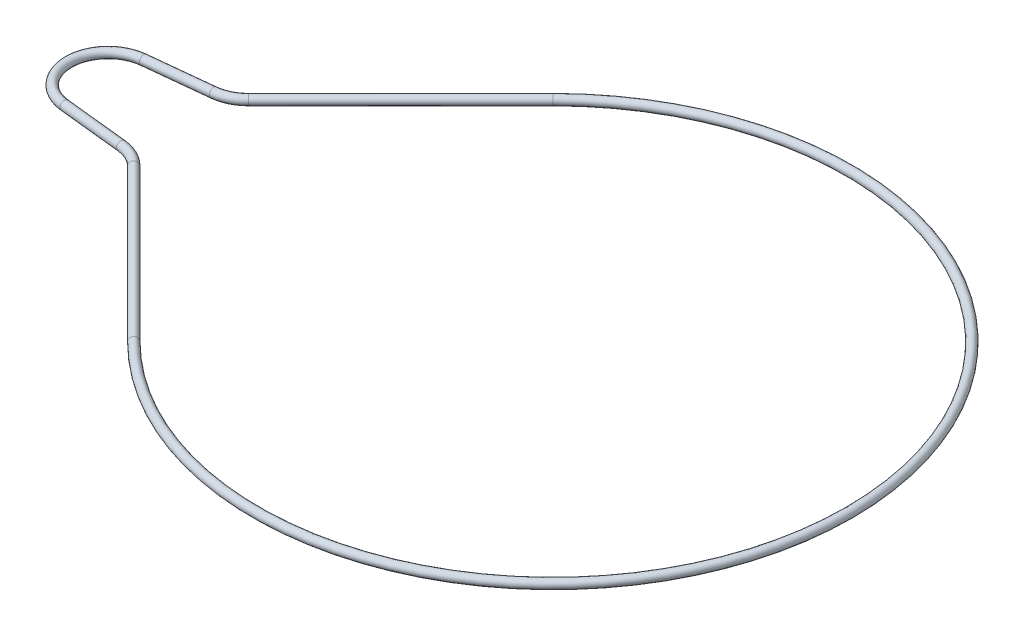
from build123d import *

# Parameters (mm, degrees)
EXTRUDE_THIN1_DEPTH = 4.75
SWEEP1_PROFILE_R    = 2.000000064


with BuildPart() as part:
    # Sketch1 → Extrude-Thin1 (new, symmetric)
    with BuildSketch(Plane(origin=(0, 0, 0), x_dir=(1, 0, 0), z_dir=(0, 1, 0))):
        with BuildLine():
            Line((-225.227915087, -7.576162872), (-81.669629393, -112.133369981))
            ThreePointArc((-81.669629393, -112.133369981), (138.7221, 0), (-81.669629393, 112.133369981))
            Line((-81.669629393, 112.133369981), (-225.227915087, 7.576162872))
            ThreePointArc((-225.227915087, 7.576162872), (-229.0826, 0), (-225.227915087, -7.576162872))
        make_face()
        with BuildLine():
            Line((-223.732545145, -5.523002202), (-80.174259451, -110.080209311))
            ThreePointArc((-80.174259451, -110.080209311), (136.1821, 0), (-80.174259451, 110.080209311))
            Line((-80.174259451, 110.080209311), (-223.732545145, 5.523002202))
            ThreePointArc((-223.732545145, 5.523002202), (-226.5426, 0), (-223.732545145, -5.523002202))
        make_face(mode=Mode.SUBTRACT)
    extrude(amount=EXTRUDE_THIN1_DEPTH, both=True)


with BuildPart() as body_2:
    # Sweep1: sweep along a path in Sketch2
    with BuildLine(Plane(origin=(0, 0, 0), x_dir=(1, 0, 0), z_dir=(0, 1, 0))) as sweep1_path:
        Line((-95.190714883, -95.190714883), (-164.283447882, -26.097981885))
        ThreePointArc((-164.283447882, -26.097981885), (-169.262170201, -22.579368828), (-175.129857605, -20.924509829))
        Line((-175.129857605, -20.924509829), (-203.892882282, -17.901394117))
        ThreePointArc((-203.892882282, -17.901394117), (-220.011369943, 0), (-203.892882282, 17.901394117))
        Line((-203.892882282, 17.901394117), (-175.129857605, 20.924509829))
        ThreePointArc((-175.129857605, 20.924509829), (-169.262170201, 22.579368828), (-164.283447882, 26.097981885))
        Line((-164.283447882, 26.097981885), (-95.190714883, 95.190714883))
        ThreePointArc((-95.190714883, 95.190714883), (134.62, 0), (-95.190714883, -95.190714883))
    # Sweep1 profile (on start of the path) → Sweep1 (sweep)
    with BuildSketch(Plane(origin=(-95.190714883, 0, 95.190714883), x_dir=(0.7071067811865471, 0, -0.7071067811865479), z_dir=(-0.7071067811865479, 0, -0.7071067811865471))):
        Circle(SWEEP1_PROFILE_R)
    sweep(path=sweep1_path.line)


solid = body_2.part
